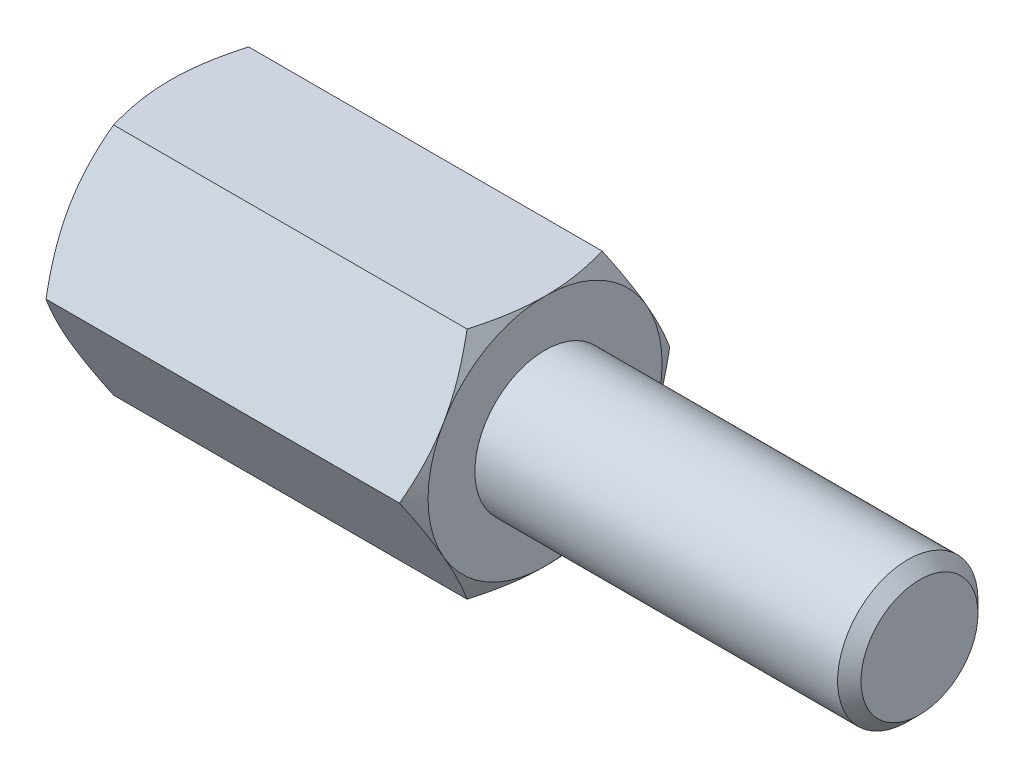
ISO-10303-21;
HEADER;
FILE_DESCRIPTION(('STEP AP214'),'2;1');
FILE_NAME('part.step','',(''),(''),'','','');
FILE_SCHEMA(('AUTOMOTIVE_DESIGN { 1 0 10303 214 1 1 1 1 }'));
ENDSEC;
DATA;
#1=APPLICATION_CONTEXT('core data for automotive mechanical design processes');
#2=APPLICATION_PROTOCOL_DEFINITION('international standard','automotive_design',2000,#1);
#3=PRODUCT_CONTEXT('',#1,'mechanical');
#4=PRODUCT('Part','Part','',(#3));
#5=PRODUCT_RELATED_PRODUCT_CATEGORY('part','',(#4));
#6=PRODUCT_DEFINITION_FORMATION('','',#4);
#7=PRODUCT_DEFINITION_CONTEXT('part definition',#1,'design');
#8=PRODUCT_DEFINITION('design','',#6,#7);
#9=PRODUCT_DEFINITION_SHAPE('','',#8);
#10=(LENGTH_UNIT() NAMED_UNIT(*) SI_UNIT(.MILLI.,.METRE.));
#11=(NAMED_UNIT(*) PLANE_ANGLE_UNIT() SI_UNIT($,.RADIAN.));
#12=(NAMED_UNIT(*) SI_UNIT($,.STERADIAN.) SOLID_ANGLE_UNIT());
#13=UNCERTAINTY_MEASURE_WITH_UNIT(LENGTH_MEASURE(1.E-05),#10,'distance_accuracy_value','');
#14=(GEOMETRIC_REPRESENTATION_CONTEXT(3) GLOBAL_UNCERTAINTY_ASSIGNED_CONTEXT((#13)) GLOBAL_UNIT_ASSIGNED_CONTEXT((#10,
#11,#12)) REPRESENTATION_CONTEXT('',''));
#15=CARTESIAN_POINT('',(0.,0.,0.));
#16=DIRECTION('',(0.,0.,1.));
#17=DIRECTION('',(1.,0.,0.));
#18=AXIS2_PLACEMENT_3D('',#15,#16,#17);
#19=CARTESIAN_POINT('',(4.,2.5,-1.44337567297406));
#20=DIRECTION('',(1.,0.,0.));
#21=DIRECTION('',(0.,0.,-1.));
#22=AXIS2_PLACEMENT_3D('',#19,#20,#21);
#23=PLANE('',#22);
#24=CARTESIAN_POINT('',(4.,0.,0.));
#25=DIRECTION('',(1.,0.,0.));
#26=DIRECTION('',(0.,0.,-1.));
#27=AXIS2_PLACEMENT_3D('',#24,#25,#26);
#28=CIRCLE('',#27,2.5);
#29=CARTESIAN_POINT('',(4.,-1.25,-2.1650635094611));
#30=VERTEX_POINT('',#29);
#31=CARTESIAN_POINT('',(4.,1.25,-2.1650635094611));
#32=VERTEX_POINT('',#31);
#33=EDGE_CURVE('E288',#30,#32,#28,.T.);
#34=ORIENTED_EDGE('',*,*,#33,.T.);
#35=CARTESIAN_POINT('',(4.,2.5,0.));
#36=VERTEX_POINT('',#35);
#37=EDGE_CURVE('E53',#32,#36,#28,.T.);
#38=ORIENTED_EDGE('',*,*,#37,.T.);
#39=CARTESIAN_POINT('',(4.,1.25,2.1650635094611));
#40=VERTEX_POINT('',#39);
#41=EDGE_CURVE('E295',#36,#40,#28,.T.);
#42=ORIENTED_EDGE('',*,*,#41,.T.);
#43=CARTESIAN_POINT('',(4.,-1.25,2.1650635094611));
#44=VERTEX_POINT('',#43);
#45=EDGE_CURVE('E299',#40,#44,#28,.T.);
#46=ORIENTED_EDGE('',*,*,#45,.T.);
#47=CARTESIAN_POINT('',(4.,0.,0.));
#48=DIRECTION('',(-1.,0.,0.));
#49=DIRECTION('',(0.,-1.,0.));
#50=AXIS2_PLACEMENT_3D('',#47,#48,#49);
#51=CIRCLE('',#50,2.5);
#52=CARTESIAN_POINT('',(4.,-2.5,0.));
#53=VERTEX_POINT('',#52);
#54=EDGE_CURVE('E193',#53,#44,#51,.T.);
#55=ORIENTED_EDGE('',*,*,#54,.F.);
#56=EDGE_CURVE('E61',#53,#30,#28,.T.);
#57=ORIENTED_EDGE('',*,*,#56,.T.);
#58=EDGE_LOOP('',(#34,#38,#42,#46,#55,#57));
#59=FACE_BOUND('',#58,.T.);
#60=CARTESIAN_POINT('',(4.,0.,0.));
#61=DIRECTION('',(1.,0.,0.));
#62=DIRECTION('',(0.,0.,-1.));
#63=AXIS2_PLACEMENT_3D('',#60,#61,#62);
#64=CIRCLE('',#63,1.5);
#65=CARTESIAN_POINT('',(4.,0.,-1.5));
#66=VERTEX_POINT('',#65);
#67=EDGE_CURVE('E386',#66,#66,#64,.T.);
#68=ORIENTED_EDGE('',*,*,#67,.F.);
#69=EDGE_LOOP('',(#68));
#70=FACE_BOUND('',#69,.T.);
#71=ADVANCED_FACE('F37',(#59,#70),#23,.T.);
#72=CARTESIAN_POINT('',(4.,0.,-2.88675134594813));
#73=DIRECTION('',(0.,-0.5,0.866025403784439));
#74=DIRECTION('',(0.,-0.866025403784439,-0.5));
#75=AXIS2_PLACEMENT_3D('',#72,#73,#74);
#76=PLANE('',#75);
#77=CARTESIAN_POINT('',(3.77664233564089,-0.000199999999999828,-2.88686681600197));
#78=CARTESIAN_POINT('',(3.81327837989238,0.109663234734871,-2.82343724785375));
#79=CARTESIAN_POINT('',(3.84659778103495,0.220474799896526,-2.75946016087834));
#80=CARTESIAN_POINT('',(3.90475771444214,0.444016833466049,-2.63039810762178));
#81=CARTESIAN_POINT('',(3.92957767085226,0.556751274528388,-2.5653108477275));
#82=CARTESIAN_POINT('',(3.96821434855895,0.780822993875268,-2.43594298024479));
#83=CARTESIAN_POINT('',(3.98228820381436,0.892125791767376,-2.37168227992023));
#84=CARTESIAN_POINT('',(3.99909084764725,1.11525522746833,-2.24285844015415));
#85=CARTESIAN_POINT('',(4.00183354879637,1.22708105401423,-2.17829576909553));
#86=CARTESIAN_POINT('',(3.99613423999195,1.43604197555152,-2.05765212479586));
#87=CARTESIAN_POINT('',(3.98909160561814,1.53320831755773,-2.0015531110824));
#88=CARTESIAN_POINT('',(3.96676858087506,1.726907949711,-1.88972057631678));
#89=CARTESIAN_POINT('',(3.95148056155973,1.82344056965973,-1.8339874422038));
#90=CARTESIAN_POINT('',(3.91326090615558,2.01753972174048,-1.7219242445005));
#91=CARTESIAN_POINT('',(3.89016722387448,2.11508168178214,-1.66560836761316));
#92=CARTESIAN_POINT('',(3.83775334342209,2.30871060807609,-1.55381665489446));
#93=CARTESIAN_POINT('',(3.80844546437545,2.40480005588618,-1.49833938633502));
#94=CARTESIAN_POINT('',(3.77664233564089,2.5002,-1.44326020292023));
#95=B_SPLINE_CURVE_WITH_KNOTS('',3,(#77,#78,#79,#80,#81,#82,#83,#84,#85,#86,#87,#88,#89,#90,#91,
#92,#93,#94),.UNSPECIFIED.,.F.,.F.,(4,2,2,2,2,2,2,2,4),(0.,0.396285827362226,0.79352433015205,
1.18093086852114,1.56786160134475,1.90479741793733,2.24204551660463,2.58677531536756,
2.93082800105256),.UNSPECIFIED.);
#96=CARTESIAN_POINT('',(3.7767090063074,0.,-2.88675134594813));
#97=VERTEX_POINT('',#96);
#98=EDGE_CURVE('E351',#97,#32,#95,.T.);
#99=ORIENTED_EDGE('',*,*,#98,.F.);
#100=DIRECTION('',(-1.,0.,0.));
#101=VECTOR('',#100,1.);
#102=CARTESIAN_POINT('',(4.,0.,-2.88675134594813));
#103=LINE('',#102,#101);
#104=CARTESIAN_POINT('',(-3.7767090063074,0.,-2.88675134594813));
#105=VERTEX_POINT('',#104);
#106=EDGE_CURVE('E264',#97,#105,#103,.T.);
#107=ORIENTED_EDGE('',*,*,#106,.T.);
#108=CARTESIAN_POINT('',(-3.77664233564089,2.5002,-1.44326020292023));
#109=CARTESIAN_POINT('',(-3.81327837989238,2.39033676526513,-1.50668977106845));
#110=CARTESIAN_POINT('',(-3.84659778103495,2.27952520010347,-1.57066685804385));
#111=CARTESIAN_POINT('',(-3.90475771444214,2.05598316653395,-1.69972891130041));
#112=CARTESIAN_POINT('',(-3.92957767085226,1.94324872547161,-1.7648161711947));
#113=CARTESIAN_POINT('',(-3.96821434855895,1.71917700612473,-1.8941840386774));
#114=CARTESIAN_POINT('',(-3.98228820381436,1.60787420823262,-1.95844473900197));
#115=CARTESIAN_POINT('',(-3.99909084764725,1.38474477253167,-2.08726857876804));
#116=CARTESIAN_POINT('',(-4.00183354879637,1.27291894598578,-2.15183124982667));
#117=CARTESIAN_POINT('',(-3.99613423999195,1.06395802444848,-2.27247489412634));
#118=CARTESIAN_POINT('',(-3.98909160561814,0.966791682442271,-2.32857390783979));
#119=CARTESIAN_POINT('',(-3.96676858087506,0.773092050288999,-2.44040644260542));
#120=CARTESIAN_POINT('',(-3.95148056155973,0.676559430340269,-2.49613957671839));
#121=CARTESIAN_POINT('',(-3.91326090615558,0.482460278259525,-2.60820277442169));
#122=CARTESIAN_POINT('',(-3.89016722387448,0.38491831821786,-2.66451865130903));
#123=CARTESIAN_POINT('',(-3.83775334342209,0.191289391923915,-2.77631036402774));
#124=CARTESIAN_POINT('',(-3.80844546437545,0.0951999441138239,-2.83178763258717));
#125=CARTESIAN_POINT('',(-3.77664233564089,-0.000200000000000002,-2.88686681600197));
#126=B_SPLINE_CURVE_WITH_KNOTS('',3,(#108,#109,#110,#111,#112,#113,#114,#115,#116,#117,#118,
#119,#120,#121,#122,#123,#124,#125),.UNSPECIFIED.,.F.,.F.,(4,2,2,2,2,2,2,2,4),(0.,
0.396285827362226,0.793524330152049,1.18093086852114,1.56786160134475,1.90479741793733,
2.24204551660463,2.58677531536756,2.93082800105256),.UNSPECIFIED.);
#127=CARTESIAN_POINT('',(-4.,1.25,-2.1650635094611));
#128=VERTEX_POINT('',#127);
#129=EDGE_CURVE('E398',#128,#105,#126,.T.);
#130=ORIENTED_EDGE('',*,*,#129,.F.);
#131=CARTESIAN_POINT('',(-3.7767090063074,2.5,-1.44337567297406));
#132=VERTEX_POINT('',#131);
#133=EDGE_CURVE('E310',#132,#128,#126,.T.);
#134=ORIENTED_EDGE('',*,*,#133,.F.);
#135=DIRECTION('',(-1.,0.,0.));
#136=VECTOR('',#135,1.);
#137=CARTESIAN_POINT('',(4.,2.5,-1.44337567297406));
#138=LINE('',#137,#136);
#139=CARTESIAN_POINT('',(3.77670900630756,2.5,-1.44337567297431));
#140=VERTEX_POINT('',#139);
#141=EDGE_CURVE('E279',#140,#132,#138,.T.);
#142=ORIENTED_EDGE('',*,*,#141,.F.);
#143=EDGE_CURVE('E229',#32,#140,#95,.T.);
#144=ORIENTED_EDGE('',*,*,#143,.F.);
#145=EDGE_LOOP('',(#99,#107,#130,#134,#142,#144));
#146=FACE_BOUND('',#145,.T.);
#147=ADVANCED_FACE('F148',(#146),#76,.F.);
#148=CARTESIAN_POINT('',(4.,2.5,-1.44337567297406));
#149=DIRECTION('',(0.,-1.,0.));
#150=DIRECTION('',(0.,0.,-1.));
#151=AXIS2_PLACEMENT_3D('',#148,#149,#150);
#152=PLANE('',#151);
#153=CARTESIAN_POINT('',(2.76803388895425,2.5,-3.90158441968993));
#154=CARTESIAN_POINT('',(2.82120772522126,2.5,-3.79217004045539));
#155=CARTESIAN_POINT('',(2.87387869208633,2.5,-3.68250707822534));
#156=CARTESIAN_POINT('',(2.97793249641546,2.5,-3.46255185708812));
#157=CARTESIAN_POINT('',(3.02931513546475,2.5,-3.35225950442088));
#158=CARTESIAN_POINT('',(3.13076309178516,2.5,-3.130356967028));
#159=CARTESIAN_POINT('',(3.18081992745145,2.5,-3.01874289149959));
#160=CARTESIAN_POINT('',(3.27891712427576,2.5,-2.79463535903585));
#161=CARTESIAN_POINT('',(3.32695757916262,2.5,-2.68214194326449));
#162=CARTESIAN_POINT('',(3.42201845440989,2.5,-2.45240385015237));
#163=CARTESIAN_POINT('',(3.46895431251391,2.5,-2.33512399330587));
#164=CARTESIAN_POINT('',(3.55933269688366,2.5,-2.09920133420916));
#165=CARTESIAN_POINT('',(3.60277483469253,2.5,-1.98055838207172));
#166=CARTESIAN_POINT('',(3.68504351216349,2.5,-1.74193489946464));
#167=CARTESIAN_POINT('',(3.72387917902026,2.5,-1.6219575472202));
#168=CARTESIAN_POINT('',(3.79570507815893,2.5,-1.38028205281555));
#169=CARTESIAN_POINT('',(3.82869712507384,2.5,-1.25858445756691));
#170=CARTESIAN_POINT('',(3.88709594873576,2.5,-1.01406369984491));
#171=CARTESIAN_POINT('',(3.91254379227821,2.5,-0.891250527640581));
#172=CARTESIAN_POINT('',(3.95442751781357,2.5,-0.64407172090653));
#173=CARTESIAN_POINT('',(3.97086432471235,2.5,-0.519706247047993));
#174=CARTESIAN_POINT('',(3.9932006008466,2.5,-0.271679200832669));
#175=CARTESIAN_POINT('',(3.99923751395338,2.5,-0.148030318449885));
#176=CARTESIAN_POINT('',(4.00062561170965,2.5,0.0993395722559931));
#177=CARTESIAN_POINT('',(3.99597656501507,2.5,0.223060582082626));
#178=CARTESIAN_POINT('',(3.97940443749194,2.5,0.432351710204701));
#179=CARTESIAN_POINT('',(3.97010665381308,2.5,0.518143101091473));
#180=CARTESIAN_POINT('',(3.94693847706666,2.5,0.689112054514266));
#181=CARTESIAN_POINT('',(3.93306748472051,2.5,0.774289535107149));
#182=CARTESIAN_POINT('',(3.88532020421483,2.5,1.02876599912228));
#183=CARTESIAN_POINT('',(3.84531764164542,2.5,1.19691958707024));
#184=CARTESIAN_POINT('',(3.75226567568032,2.5,1.53362893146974));
#185=CARTESIAN_POINT('',(3.69893620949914,2.5,1.70210423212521));
#186=CARTESIAN_POINT('',(3.61237169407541,2.5,1.95247339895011));
#187=CARTESIAN_POINT('',(3.58242477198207,2.5,2.03553184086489));
#188=CARTESIAN_POINT('',(3.52068409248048,2.5,2.20095860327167));
#189=CARTESIAN_POINT('',(3.48889037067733,2.5,2.2833269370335));
#190=CARTESIAN_POINT('',(3.40401426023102,2.5,2.49723312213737));
#191=CARTESIAN_POINT('',(3.34971733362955,2.5,2.6282879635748));
#192=CARTESIAN_POINT('',(3.23812739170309,2.5,2.88912034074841));
#193=CARTESIAN_POINT('',(3.1808341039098,2.5,3.01889775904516));
#194=CARTESIAN_POINT('',(3.06393487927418,2.5,3.27745045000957));
#195=CARTESIAN_POINT('',(3.00432825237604,2.5,3.40622540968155));
#196=CARTESIAN_POINT('',(2.8833234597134,2.5,3.66293235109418));
#197=CARTESIAN_POINT('',(2.82192524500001,2.5,3.79086430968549));
#198=CARTESIAN_POINT('',(2.6354580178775,2.5,4.17399495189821));
#199=CARTESIAN_POINT('',(2.50828249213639,2.5,4.42816724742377));
#200=CARTESIAN_POINT('',(2.25034557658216,2.5,4.93461464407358));
#201=CARTESIAN_POINT('',(2.11958483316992,2.5,5.18689007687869));
#202=CARTESIAN_POINT('',(1.86871001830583,2.5,5.66512451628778));
#203=CARTESIAN_POINT('',(1.74882986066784,2.5,5.89120644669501));
#204=CARTESIAN_POINT('',(1.50759021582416,2.5,6.34259369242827));
#205=CARTESIAN_POINT('',(1.38623065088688,2.5,6.56789896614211));
#206=CARTESIAN_POINT('',(1.14278038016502,2.5,7.01722044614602));
#207=CARTESIAN_POINT('',(1.02069305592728,2.5,7.24123848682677));
#208=CARTESIAN_POINT('',(0.775666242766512,2.5,7.68878772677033));
#209=CARTESIAN_POINT('',(0.652726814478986,2.5,7.9123189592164));
#210=CARTESIAN_POINT('',(0.529475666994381,2.5,8.13567697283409));
#211=B_SPLINE_CURVE_WITH_KNOTS('',3,(#153,#154,#155,#156,#157,#158,#159,#160,#161,#162,#163,
#164,#165,#166,#167,#168,#169,#170,#171,#172,#173,#174,#175,#176,#177,#178,#179,#180,#181,#182,
#183,#184,#185,#186,#187,#188,#189,#190,#191,#192,#193,#194,#195,#196,#197,#198,#199,#200,#201,
#202,#203,#204,#205,#206,#207,#208,#209,#210),.UNSPECIFIED.,.F.,.F.,(4,2,2,2,2,2,2,2,2,2,2,2,2,
2,2,2,2,2,2,2,2,2,2,2,2,2,2,2,4),(0.,0.364957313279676,0.729970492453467,1.09692930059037,
1.46387103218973,1.84279746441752,2.22176597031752,2.59997058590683,2.97805755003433,
3.35404692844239,3.72999770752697,4.10094071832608,4.47189175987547,4.73064905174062,
4.98944026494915,5.5072907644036,6.03710483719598,6.30196454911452,6.56681915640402,
6.99233818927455,7.41789598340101,7.84358170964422,8.26927907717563,9.12186602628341,
9.97430025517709,10.7419897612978,11.5097197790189,12.2750964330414,13.0404191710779),.UNSPECIFIED.);
#212=EDGE_CURVE('E227',#140,#36,#211,.T.);
#213=ORIENTED_EDGE('',*,*,#212,.F.);
#214=ORIENTED_EDGE('',*,*,#141,.T.);
#215=CARTESIAN_POINT('',(-2.76803388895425,2.5,-3.90158441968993));
#216=CARTESIAN_POINT('',(-2.82120772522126,2.5,-3.79217004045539));
#217=CARTESIAN_POINT('',(-2.87387869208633,2.5,-3.68250707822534));
#218=CARTESIAN_POINT('',(-2.97793249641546,2.5,-3.46255185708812));
#219=CARTESIAN_POINT('',(-3.02931513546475,2.5,-3.35225950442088));
#220=CARTESIAN_POINT('',(-3.13076309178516,2.5,-3.130356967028));
#221=CARTESIAN_POINT('',(-3.18081992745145,2.5,-3.01874289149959));
#222=CARTESIAN_POINT('',(-3.27891712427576,2.5,-2.79463535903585));
#223=CARTESIAN_POINT('',(-3.32695757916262,2.5,-2.68214194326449));
#224=CARTESIAN_POINT('',(-3.42201845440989,2.5,-2.45240385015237));
#225=CARTESIAN_POINT('',(-3.46895431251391,2.5,-2.33512399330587));
#226=CARTESIAN_POINT('',(-3.55933269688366,2.5,-2.09920133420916));
#227=CARTESIAN_POINT('',(-3.60277483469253,2.5,-1.98055838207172));
#228=CARTESIAN_POINT('',(-3.68504351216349,2.5,-1.74193489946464));
#229=CARTESIAN_POINT('',(-3.72387917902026,2.5,-1.6219575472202));
#230=CARTESIAN_POINT('',(-3.79570507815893,2.5,-1.38028205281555));
#231=CARTESIAN_POINT('',(-3.82869712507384,2.5,-1.25858445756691));
#232=CARTESIAN_POINT('',(-3.88709594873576,2.5,-1.01406369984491));
#233=CARTESIAN_POINT('',(-3.91254379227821,2.5,-0.89125052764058));
#234=CARTESIAN_POINT('',(-3.95442751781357,2.5,-0.64407172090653));
#235=CARTESIAN_POINT('',(-3.97086432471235,2.5,-0.519706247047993));
#236=CARTESIAN_POINT('',(-3.9932006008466,2.5,-0.271679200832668));
#237=CARTESIAN_POINT('',(-3.99923751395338,2.5,-0.148030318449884));
#238=CARTESIAN_POINT('',(-4.00062561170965,2.5,0.0993395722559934));
#239=CARTESIAN_POINT('',(-3.99597656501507,2.5,0.223060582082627));
#240=CARTESIAN_POINT('',(-3.97940443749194,2.5,0.432351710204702));
#241=CARTESIAN_POINT('',(-3.97010665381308,2.5,0.518143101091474));
#242=CARTESIAN_POINT('',(-3.94693847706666,2.5,0.689112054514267));
#243=CARTESIAN_POINT('',(-3.93306748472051,2.5,0.774289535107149));
#244=CARTESIAN_POINT('',(-3.88532020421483,2.5,1.02876599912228));
#245=CARTESIAN_POINT('',(-3.84531764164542,2.5,1.19691958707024));
#246=CARTESIAN_POINT('',(-3.75226567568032,2.5,1.53362893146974));
#247=CARTESIAN_POINT('',(-3.69893620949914,2.5,1.70210423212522));
#248=CARTESIAN_POINT('',(-3.61237169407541,2.5,1.95247339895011));
#249=CARTESIAN_POINT('',(-3.58242477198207,2.5,2.03553184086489));
#250=CARTESIAN_POINT('',(-3.52068409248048,2.5,2.20095860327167));
#251=CARTESIAN_POINT('',(-3.48889037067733,2.5,2.2833269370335));
#252=CARTESIAN_POINT('',(-3.40401426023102,2.5,2.49723312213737));
#253=CARTESIAN_POINT('',(-3.34971733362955,2.5,2.6282879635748));
#254=CARTESIAN_POINT('',(-3.23812739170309,2.5,2.88912034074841));
#255=CARTESIAN_POINT('',(-3.1808341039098,2.5,3.01889775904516));
#256=CARTESIAN_POINT('',(-3.06393487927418,2.5,3.27745045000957));
#257=CARTESIAN_POINT('',(-3.00432825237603,2.5,3.40622540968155));
#258=CARTESIAN_POINT('',(-2.8833234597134,2.5,3.66293235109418));
#259=CARTESIAN_POINT('',(-2.82192524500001,2.5,3.79086430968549));
#260=CARTESIAN_POINT('',(-2.6354580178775,2.5,4.17399495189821));
#261=CARTESIAN_POINT('',(-2.50828249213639,2.5,4.42816724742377));
#262=CARTESIAN_POINT('',(-2.25034557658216,2.5,4.93461464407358));
#263=CARTESIAN_POINT('',(-2.11958483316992,2.5,5.18689007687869));
#264=CARTESIAN_POINT('',(-1.86871001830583,2.5,5.66512451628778));
#265=CARTESIAN_POINT('',(-1.74882986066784,2.5,5.89120644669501));
#266=CARTESIAN_POINT('',(-1.50759021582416,2.5,6.34259369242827));
#267=CARTESIAN_POINT('',(-1.38623065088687,2.5,6.56789896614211));
#268=CARTESIAN_POINT('',(-1.14278038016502,2.5,7.01722044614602));
#269=CARTESIAN_POINT('',(-1.02069305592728,2.5,7.24123848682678));
#270=CARTESIAN_POINT('',(-0.775666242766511,2.5,7.68878772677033));
#271=CARTESIAN_POINT('',(-0.652726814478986,2.5,7.9123189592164));
#272=CARTESIAN_POINT('',(-0.529475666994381,2.5,8.13567697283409));
#273=B_SPLINE_CURVE_WITH_KNOTS('',3,(#215,#216,#217,#218,#219,#220,#221,#222,#223,#224,#225,
#226,#227,#228,#229,#230,#231,#232,#233,#234,#235,#236,#237,#238,#239,#240,#241,#242,#243,#244,
#245,#246,#247,#248,#249,#250,#251,#252,#253,#254,#255,#256,#257,#258,#259,#260,#261,#262,#263,
#264,#265,#266,#267,#268,#269,#270,#271,#272),.UNSPECIFIED.,.F.,.F.,(4,2,2,2,2,2,2,2,2,2,2,2,2,
2,2,2,2,2,2,2,2,2,2,2,2,2,2,2,4),(0.,0.364957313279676,0.729970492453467,1.09692930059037,
1.46387103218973,1.84279746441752,2.22176597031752,2.59997058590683,2.97805755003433,
3.35404692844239,3.72999770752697,4.10094071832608,4.47189175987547,4.73064905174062,
4.98944026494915,5.5072907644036,6.03710483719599,6.30196454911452,6.56681915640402,
6.99233818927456,7.41789598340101,7.84358170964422,8.26927907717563,9.12186602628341,
9.97430025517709,10.7419897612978,11.5097197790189,12.2750964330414,13.0404191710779),.UNSPECIFIED.);
#274=CARTESIAN_POINT('',(-4.,2.5,0.));
#275=VERTEX_POINT('',#274);
#276=EDGE_CURVE('E241',#275,#132,#273,.F.);
#277=ORIENTED_EDGE('',*,*,#276,.F.);
#278=CARTESIAN_POINT('',(-3.7767090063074,2.5,1.44337567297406));
#279=VERTEX_POINT('',#278);
#280=EDGE_CURVE('E249',#279,#275,#273,.F.);
#281=ORIENTED_EDGE('',*,*,#280,.F.);
#282=DIRECTION('',(-1.,0.,0.));
#283=VECTOR('',#282,1.);
#284=CARTESIAN_POINT('',(4.,2.5,1.44337567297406));
#285=LINE('',#284,#283);
#286=CARTESIAN_POINT('',(3.7767090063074,2.5,1.44337567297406));
#287=VERTEX_POINT('',#286);
#288=EDGE_CURVE('E276',#287,#279,#285,.T.);
#289=ORIENTED_EDGE('',*,*,#288,.F.);
#290=EDGE_CURVE('E221',#36,#287,#211,.T.);
#291=ORIENTED_EDGE('',*,*,#290,.F.);
#292=EDGE_LOOP('',(#213,#214,#277,#281,#289,#291));
#293=FACE_BOUND('',#292,.T.);
#294=ADVANCED_FACE('F153',(#293),#152,.F.);
#295=CARTESIAN_POINT('',(4.,2.5,1.44337567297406));
#296=DIRECTION('',(0.,-0.5,-0.866025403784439));
#297=DIRECTION('',(0.,0.866025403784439,-0.5));
#298=AXIS2_PLACEMENT_3D('',#295,#296,#297);
#299=PLANE('',#298);
#300=CARTESIAN_POINT('',(3.77664233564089,2.5002,1.44326020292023));
#301=CARTESIAN_POINT('',(3.81327837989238,2.39033676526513,1.50668977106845));
#302=CARTESIAN_POINT('',(3.84659778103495,2.27952520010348,1.57066685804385));
#303=CARTESIAN_POINT('',(3.90475771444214,2.05598316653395,1.69972891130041));
#304=CARTESIAN_POINT('',(3.92957767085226,1.94324872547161,1.7648161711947));
#305=CARTESIAN_POINT('',(3.96821434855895,1.71917700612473,1.8941840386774));
#306=CARTESIAN_POINT('',(3.98228820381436,1.60787420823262,1.95844473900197));
#307=CARTESIAN_POINT('',(3.99909084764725,1.38474477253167,2.08726857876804));
#308=CARTESIAN_POINT('',(4.00183354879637,1.27291894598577,2.15183124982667));
#309=CARTESIAN_POINT('',(3.99613423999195,1.06395802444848,2.27247489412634));
#310=CARTESIAN_POINT('',(3.98909160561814,0.96679168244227,2.32857390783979));
#311=CARTESIAN_POINT('',(3.96676858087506,0.773092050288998,2.44040644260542));
#312=CARTESIAN_POINT('',(3.95148056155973,0.676559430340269,2.49613957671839));
#313=CARTESIAN_POINT('',(3.91326090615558,0.482460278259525,2.60820277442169));
#314=CARTESIAN_POINT('',(3.89016722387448,0.384918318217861,2.66451865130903));
#315=CARTESIAN_POINT('',(3.83775334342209,0.191289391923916,2.77631036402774));
#316=CARTESIAN_POINT('',(3.80844546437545,0.0951999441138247,2.83178763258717));
#317=CARTESIAN_POINT('',(3.77664233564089,-0.000199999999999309,2.88686681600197));
#318=B_SPLINE_CURVE_WITH_KNOTS('',3,(#300,#301,#302,#303,#304,#305,#306,#307,#308,#309,#310,
#311,#312,#313,#314,#315,#316,#317),.UNSPECIFIED.,.F.,.F.,(4,2,2,2,2,2,2,2,4),(0.,
0.396285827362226,0.79352433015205,1.18093086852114,1.56786160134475,1.90479741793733,
2.24204551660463,2.58677531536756,2.93082800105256),.UNSPECIFIED.);
#319=EDGE_CURVE('E228',#287,#40,#318,.T.);
#320=ORIENTED_EDGE('',*,*,#319,.F.);
#321=ORIENTED_EDGE('',*,*,#288,.T.);
#322=CARTESIAN_POINT('',(-3.77664233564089,-0.00019999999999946,2.88686681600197));
#323=CARTESIAN_POINT('',(-3.81327837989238,0.109663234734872,2.82343724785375));
#324=CARTESIAN_POINT('',(-3.84659778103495,0.220474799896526,2.75946016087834));
#325=CARTESIAN_POINT('',(-3.90475771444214,0.44401683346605,2.63039810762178));
#326=CARTESIAN_POINT('',(-3.92957767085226,0.556751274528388,2.5653108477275));
#327=CARTESIAN_POINT('',(-3.96821434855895,0.780822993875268,2.43594298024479));
#328=CARTESIAN_POINT('',(-3.98228820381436,0.892125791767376,2.37168227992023));
#329=CARTESIAN_POINT('',(-3.99909084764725,1.11525522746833,2.24285844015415));
#330=CARTESIAN_POINT('',(-4.00183354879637,1.22708105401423,2.17829576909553));
#331=CARTESIAN_POINT('',(-3.99613423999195,1.43604197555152,2.05765212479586));
#332=CARTESIAN_POINT('',(-3.98909160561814,1.53320831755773,2.0015531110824));
#333=CARTESIAN_POINT('',(-3.96676858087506,1.726907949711,1.88972057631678));
#334=CARTESIAN_POINT('',(-3.95148056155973,1.82344056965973,1.8339874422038));
#335=CARTESIAN_POINT('',(-3.91326090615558,2.01753972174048,1.7219242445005));
#336=CARTESIAN_POINT('',(-3.89016722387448,2.11508168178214,1.66560836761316));
#337=CARTESIAN_POINT('',(-3.83775334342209,2.30871060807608,1.55381665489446));
#338=CARTESIAN_POINT('',(-3.80844546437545,2.40480005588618,1.49833938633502));
#339=CARTESIAN_POINT('',(-3.77664233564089,2.5002,1.44326020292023));
#340=B_SPLINE_CURVE_WITH_KNOTS('',3,(#322,#323,#324,#325,#326,#327,#328,#329,#330,#331,#332,
#333,#334,#335,#336,#337,#338,#339),.UNSPECIFIED.,.F.,.F.,(4,2,2,2,2,2,2,2,4),(0.,
0.396285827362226,0.793524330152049,1.18093086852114,1.56786160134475,1.90479741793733,
2.24204551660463,2.58677531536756,2.93082800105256),.UNSPECIFIED.);
#341=CARTESIAN_POINT('',(-4.,1.25,2.1650635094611));
#342=VERTEX_POINT('',#341);
#343=EDGE_CURVE('E255',#342,#279,#340,.T.);
#344=ORIENTED_EDGE('',*,*,#343,.F.);
#345=CARTESIAN_POINT('',(-3.7767090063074,0.,2.88675134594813));
#346=VERTEX_POINT('',#345);
#347=EDGE_CURVE('E262',#346,#342,#340,.T.);
#348=ORIENTED_EDGE('',*,*,#347,.F.);
#349=DIRECTION('',(-1.,0.,0.));
#350=VECTOR('',#349,1.);
#351=CARTESIAN_POINT('',(4.,0.,2.88675134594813));
#352=LINE('',#351,#350);
#353=CARTESIAN_POINT('',(3.7767090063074,0.,2.88675134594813));
#354=VERTEX_POINT('',#353);
#355=EDGE_CURVE('E273',#354,#346,#352,.T.);
#356=ORIENTED_EDGE('',*,*,#355,.F.);
#357=EDGE_CURVE('E215',#40,#354,#318,.T.);
#358=ORIENTED_EDGE('',*,*,#357,.F.);
#359=EDGE_LOOP('',(#320,#321,#344,#348,#356,#358));
#360=FACE_BOUND('',#359,.T.);
#361=ADVANCED_FACE('F235',(#360),#299,.F.);
#362=CARTESIAN_POINT('',(4.,0.,2.88675134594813));
#363=DIRECTION('',(0.,0.5,-0.866025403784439));
#364=DIRECTION('',(0.,0.866025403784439,0.5));
#365=AXIS2_PLACEMENT_3D('',#362,#363,#364);
#366=PLANE('',#365);
#367=CARTESIAN_POINT('',(3.77664233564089,0.000200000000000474,2.88686681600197));
#368=CARTESIAN_POINT('',(3.81327837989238,-0.109663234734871,2.82343724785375));
#369=CARTESIAN_POINT('',(3.84659778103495,-0.220474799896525,2.75946016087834));
#370=CARTESIAN_POINT('',(3.90475771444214,-0.444016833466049,2.63039810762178));
#371=CARTESIAN_POINT('',(3.92957767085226,-0.556751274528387,2.5653108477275));
#372=CARTESIAN_POINT('',(3.96821434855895,-0.780822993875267,2.43594298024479));
#373=CARTESIAN_POINT('',(3.98228820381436,-0.892125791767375,2.37168227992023));
#374=CARTESIAN_POINT('',(3.99909084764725,-1.11525522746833,2.24285844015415));
#375=CARTESIAN_POINT('',(4.00183354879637,-1.22708105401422,2.17829576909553));
#376=CARTESIAN_POINT('',(3.99613423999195,-1.43604197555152,2.05765212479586));
#377=CARTESIAN_POINT('',(3.98909160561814,-1.53320831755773,2.0015531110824));
#378=CARTESIAN_POINT('',(3.96676858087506,-1.726907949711,1.88972057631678));
#379=CARTESIAN_POINT('',(3.95148056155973,-1.82344056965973,1.8339874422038));
#380=CARTESIAN_POINT('',(3.91326090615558,-2.01753972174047,1.7219242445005));
#381=CARTESIAN_POINT('',(3.89016722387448,-2.11508168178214,1.66560836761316));
#382=CARTESIAN_POINT('',(3.83775334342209,-2.30871060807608,1.55381665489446));
#383=CARTESIAN_POINT('',(3.80844546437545,-2.40480005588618,1.49833938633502));
#384=CARTESIAN_POINT('',(3.77664233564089,-2.5002,1.44326020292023));
#385=B_SPLINE_CURVE_WITH_KNOTS('',3,(#367,#368,#369,#370,#371,#372,#373,#374,#375,#376,#377,
#378,#379,#380,#381,#382,#383,#384),.UNSPECIFIED.,.F.,.F.,(4,2,2,2,2,2,2,2,4),(0.,
0.396285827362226,0.793524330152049,1.18093086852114,1.56786160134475,1.90479741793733,
2.24204551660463,2.58677531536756,2.93082800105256),.UNSPECIFIED.);
#386=EDGE_CURVE('E370',#354,#44,#385,.T.);
#387=ORIENTED_EDGE('',*,*,#386,.F.);
#388=ORIENTED_EDGE('',*,*,#355,.T.);
#389=CARTESIAN_POINT('',(-3.77664233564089,-2.5002,1.44326020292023));
#390=CARTESIAN_POINT('',(-3.81327837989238,-2.39033676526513,1.50668977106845));
#391=CARTESIAN_POINT('',(-3.84659778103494,-2.27952520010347,1.57066685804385));
#392=CARTESIAN_POINT('',(-3.90475771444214,-2.05598316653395,1.69972891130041));
#393=CARTESIAN_POINT('',(-3.92957767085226,-1.94324872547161,1.7648161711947));
#394=CARTESIAN_POINT('',(-3.96821434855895,-1.71917700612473,1.8941840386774));
#395=CARTESIAN_POINT('',(-3.98228820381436,-1.60787420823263,1.95844473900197));
#396=CARTESIAN_POINT('',(-3.99909084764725,-1.38474477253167,2.08726857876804));
#397=CARTESIAN_POINT('',(-4.00183354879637,-1.27291894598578,2.15183124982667));
#398=CARTESIAN_POINT('',(-3.99613423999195,-1.06395802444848,2.27247489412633));
#399=CARTESIAN_POINT('',(-3.98909160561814,-0.966791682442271,2.32857390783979));
#400=CARTESIAN_POINT('',(-3.96676858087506,-0.773092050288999,2.44040644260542));
#401=CARTESIAN_POINT('',(-3.95148056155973,-0.676559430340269,2.49613957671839));
#402=CARTESIAN_POINT('',(-3.91326090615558,-0.482460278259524,2.60820277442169));
#403=CARTESIAN_POINT('',(-3.89016722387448,-0.38491831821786,2.66451865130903));
#404=CARTESIAN_POINT('',(-3.83775334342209,-0.191289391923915,2.77631036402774));
#405=CARTESIAN_POINT('',(-3.80844546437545,-0.0951999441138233,2.83178763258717));
#406=CARTESIAN_POINT('',(-3.77664233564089,0.000200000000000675,2.88686681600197));
#407=B_SPLINE_CURVE_WITH_KNOTS('',3,(#389,#390,#391,#392,#393,#394,#395,#396,#397,#398,#399,
#400,#401,#402,#403,#404,#405,#406),.UNSPECIFIED.,.F.,.F.,(4,2,2,2,2,2,2,2,4),(0.,
0.396285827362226,0.793524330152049,1.18093086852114,1.56786160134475,1.90479741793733,
2.24204551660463,2.58677531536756,2.93082800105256),.UNSPECIFIED.);
#408=CARTESIAN_POINT('',(-4.,-1.25,2.1650635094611));
#409=VERTEX_POINT('',#408);
#410=EDGE_CURVE('E263',#409,#346,#407,.T.);
#411=ORIENTED_EDGE('',*,*,#410,.F.);
#412=CARTESIAN_POINT('',(-3.7767090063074,-2.5,1.44337567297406));
#413=VERTEX_POINT('',#412);
#414=EDGE_CURVE('E250',#413,#409,#407,.T.);
#415=ORIENTED_EDGE('',*,*,#414,.F.);
#416=DIRECTION('',(-1.,0.,0.));
#417=VECTOR('',#416,1.);
#418=CARTESIAN_POINT('',(4.,-2.5,1.44337567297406));
#419=LINE('',#418,#417);
#420=CARTESIAN_POINT('',(3.7767090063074,-2.5,1.44337567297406));
#421=VERTEX_POINT('',#420);
#422=EDGE_CURVE('E270',#421,#413,#419,.T.);
#423=ORIENTED_EDGE('',*,*,#422,.F.);
#424=EDGE_CURVE('E210',#44,#421,#385,.T.);
#425=ORIENTED_EDGE('',*,*,#424,.F.);
#426=EDGE_LOOP('',(#387,#388,#411,#415,#423,#425));
#427=FACE_BOUND('',#426,.T.);
#428=ADVANCED_FACE('F419',(#427),#366,.F.);
#429=CARTESIAN_POINT('',(4.,-2.5,1.44337567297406));
#430=DIRECTION('',(0.,1.,0.));
#431=DIRECTION('',(0.,0.,1.));
#432=AXIS2_PLACEMENT_3D('',#429,#430,#431);
#433=PLANE('',#432);
#434=CARTESIAN_POINT('',(2.76803388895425,-2.5,-3.90158441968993));
#435=CARTESIAN_POINT('',(2.82120772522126,-2.5,-3.79217004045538));
#436=CARTESIAN_POINT('',(2.87387869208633,-2.5,-3.68250707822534));
#437=CARTESIAN_POINT('',(2.97793249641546,-2.5,-3.46255185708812));
#438=CARTESIAN_POINT('',(3.02931513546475,-2.5,-3.35225950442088));
#439=CARTESIAN_POINT('',(3.13076309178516,-2.5,-3.130356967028));
#440=CARTESIAN_POINT('',(3.18081992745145,-2.5,-3.01874289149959));
#441=CARTESIAN_POINT('',(3.27891712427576,-2.5,-2.79463535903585));
#442=CARTESIAN_POINT('',(3.32695757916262,-2.5,-2.68214194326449));
#443=CARTESIAN_POINT('',(3.42201845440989,-2.5,-2.45240385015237));
#444=CARTESIAN_POINT('',(3.46895431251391,-2.5,-2.33512399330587));
#445=CARTESIAN_POINT('',(3.55933269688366,-2.5,-2.09920133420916));
#446=CARTESIAN_POINT('',(3.60277483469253,-2.5,-1.98055838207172));
#447=CARTESIAN_POINT('',(3.68504351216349,-2.5,-1.74193489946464));
#448=CARTESIAN_POINT('',(3.72387917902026,-2.5,-1.6219575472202));
#449=CARTESIAN_POINT('',(3.79570507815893,-2.5,-1.38028205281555));
#450=CARTESIAN_POINT('',(3.82869712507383,-2.5,-1.25858445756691));
#451=CARTESIAN_POINT('',(3.88709594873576,-2.5,-1.01406369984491));
#452=CARTESIAN_POINT('',(3.91254379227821,-2.5,-0.891250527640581));
#453=CARTESIAN_POINT('',(3.95442751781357,-2.5,-0.644071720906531));
#454=CARTESIAN_POINT('',(3.97086432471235,-2.5,-0.519706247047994));
#455=CARTESIAN_POINT('',(3.9932006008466,-2.5,-0.27167920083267));
#456=CARTESIAN_POINT('',(3.99923751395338,-2.5,-0.148030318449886));
#457=CARTESIAN_POINT('',(4.00062561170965,-2.5,0.0993395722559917));
#458=CARTESIAN_POINT('',(3.99597656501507,-2.5,0.223060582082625));
#459=CARTESIAN_POINT('',(3.97940443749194,-2.5,0.432351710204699));
#460=CARTESIAN_POINT('',(3.97010665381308,-2.5,0.518143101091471));
#461=CARTESIAN_POINT('',(3.94693847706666,-2.5,0.689112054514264));
#462=CARTESIAN_POINT('',(3.93306748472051,-2.5,0.774289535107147));
#463=CARTESIAN_POINT('',(3.88532020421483,-2.5,1.02876599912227));
#464=CARTESIAN_POINT('',(3.84531764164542,-2.5,1.19691958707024));
#465=CARTESIAN_POINT('',(3.75226567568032,-2.5,1.53362893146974));
#466=CARTESIAN_POINT('',(3.69893620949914,-2.5,1.70210423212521));
#467=CARTESIAN_POINT('',(3.61237169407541,-2.5,1.95247339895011));
#468=CARTESIAN_POINT('',(3.58242477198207,-2.5,2.03553184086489));
#469=CARTESIAN_POINT('',(3.52068409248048,-2.5,2.20095860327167));
#470=CARTESIAN_POINT('',(3.48889037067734,-2.5,2.2833269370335));
#471=CARTESIAN_POINT('',(3.40401426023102,-2.5,2.49723312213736));
#472=CARTESIAN_POINT('',(3.34971733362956,-2.5,2.6282879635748));
#473=CARTESIAN_POINT('',(3.2381273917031,-2.5,2.8891203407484));
#474=CARTESIAN_POINT('',(3.1808341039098,-2.5,3.01889775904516));
#475=CARTESIAN_POINT('',(3.06393487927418,-2.5,3.27745045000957));
#476=CARTESIAN_POINT('',(3.00432825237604,-2.5,3.40622540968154));
#477=CARTESIAN_POINT('',(2.8833234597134,-2.5,3.66293235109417));
#478=CARTESIAN_POINT('',(2.82192524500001,-2.5,3.79086430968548));
#479=CARTESIAN_POINT('',(2.6354580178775,-2.5,4.1739949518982));
#480=CARTESIAN_POINT('',(2.50828249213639,-2.5,4.42816724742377));
#481=CARTESIAN_POINT('',(2.25034557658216,-2.5,4.93461464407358));
#482=CARTESIAN_POINT('',(2.11958483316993,-2.5,5.18689007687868));
#483=CARTESIAN_POINT('',(1.86871001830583,-2.5,5.66512451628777));
#484=CARTESIAN_POINT('',(1.74882986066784,-2.5,5.891206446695));
#485=CARTESIAN_POINT('',(1.50759021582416,-2.5,6.34259369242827));
#486=CARTESIAN_POINT('',(1.38623065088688,-2.5,6.5678989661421));
#487=CARTESIAN_POINT('',(1.14278038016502,-2.5,7.01722044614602));
#488=CARTESIAN_POINT('',(1.02069305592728,-2.5,7.24123848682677));
#489=CARTESIAN_POINT('',(0.775666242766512,-2.5,7.68878772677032));
#490=CARTESIAN_POINT('',(0.652726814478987,-2.5,7.9123189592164));
#491=CARTESIAN_POINT('',(0.529475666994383,-2.5,8.13567697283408));
#492=B_SPLINE_CURVE_WITH_KNOTS('',3,(#434,#435,#436,#437,#438,#439,#440,#441,#442,#443,#444,
#445,#446,#447,#448,#449,#450,#451,#452,#453,#454,#455,#456,#457,#458,#459,#460,#461,#462,#463,
#464,#465,#466,#467,#468,#469,#470,#471,#472,#473,#474,#475,#476,#477,#478,#479,#480,#481,#482,
#483,#484,#485,#486,#487,#488,#489,#490,#491),.UNSPECIFIED.,.F.,.F.,(4,2,2,2,2,2,2,2,2,2,2,2,2,
2,2,2,2,2,2,2,2,2,2,2,2,2,2,2,4),(0.,0.364957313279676,0.729970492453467,1.09692930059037,
1.46387103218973,1.84279746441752,2.22176597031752,2.59997058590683,2.97805755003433,
3.35404692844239,3.72999770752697,4.10094071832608,4.47189175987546,4.73064905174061,
4.98944026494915,5.50729076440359,6.03710483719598,6.30196454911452,6.56681915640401,
6.99233818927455,7.417895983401,7.84358170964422,8.26927907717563,9.1218660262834,
9.97430025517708,10.7419897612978,11.5097197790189,12.2750964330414,13.0404191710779),.UNSPECIFIED.);
#493=EDGE_CURVE('E378',#421,#53,#492,.F.);
#494=ORIENTED_EDGE('',*,*,#493,.F.);
#495=ORIENTED_EDGE('',*,*,#422,.T.);
#496=CARTESIAN_POINT('',(-2.76803388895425,-2.5,-3.90158441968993));
#497=CARTESIAN_POINT('',(-2.82120772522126,-2.5,-3.79217004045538));
#498=CARTESIAN_POINT('',(-2.87387869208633,-2.5,-3.68250707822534));
#499=CARTESIAN_POINT('',(-2.97793249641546,-2.5,-3.46255185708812));
#500=CARTESIAN_POINT('',(-3.02931513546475,-2.5,-3.35225950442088));
#501=CARTESIAN_POINT('',(-3.13076309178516,-2.5,-3.130356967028));
#502=CARTESIAN_POINT('',(-3.18081992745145,-2.5,-3.01874289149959));
#503=CARTESIAN_POINT('',(-3.27891712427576,-2.5,-2.79463535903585));
#504=CARTESIAN_POINT('',(-3.32695757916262,-2.5,-2.68214194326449));
#505=CARTESIAN_POINT('',(-3.42201845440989,-2.5,-2.45240385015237));
#506=CARTESIAN_POINT('',(-3.46895431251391,-2.5,-2.33512399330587));
#507=CARTESIAN_POINT('',(-3.55933269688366,-2.5,-2.09920133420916));
#508=CARTESIAN_POINT('',(-3.60277483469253,-2.5,-1.98055838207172));
#509=CARTESIAN_POINT('',(-3.68504351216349,-2.5,-1.74193489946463));
#510=CARTESIAN_POINT('',(-3.72387917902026,-2.5,-1.6219575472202));
#511=CARTESIAN_POINT('',(-3.79570507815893,-2.5,-1.38028205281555));
#512=CARTESIAN_POINT('',(-3.82869712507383,-2.5,-1.25858445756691));
#513=CARTESIAN_POINT('',(-3.88709594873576,-2.5,-1.01406369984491));
#514=CARTESIAN_POINT('',(-3.91254379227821,-2.5,-0.891250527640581));
#515=CARTESIAN_POINT('',(-3.95442751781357,-2.5,-0.64407172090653));
#516=CARTESIAN_POINT('',(-3.97086432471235,-2.5,-0.519706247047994));
#517=CARTESIAN_POINT('',(-3.9932006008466,-2.5,-0.271679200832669));
#518=CARTESIAN_POINT('',(-3.99923751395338,-2.5,-0.148030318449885));
#519=CARTESIAN_POINT('',(-4.00062561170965,-2.5,0.0993395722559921));
#520=CARTESIAN_POINT('',(-3.99597656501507,-2.5,0.223060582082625));
#521=CARTESIAN_POINT('',(-3.97940443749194,-2.5,0.4323517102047));
#522=CARTESIAN_POINT('',(-3.97010665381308,-2.5,0.518143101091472));
#523=CARTESIAN_POINT('',(-3.94693847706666,-2.5,0.689112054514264));
#524=CARTESIAN_POINT('',(-3.93306748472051,-2.5,0.774289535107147));
#525=CARTESIAN_POINT('',(-3.88532020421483,-2.5,1.02876599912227));
#526=CARTESIAN_POINT('',(-3.84531764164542,-2.5,1.19691958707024));
#527=CARTESIAN_POINT('',(-3.75226567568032,-2.5,1.53362893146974));
#528=CARTESIAN_POINT('',(-3.69893620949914,-2.5,1.70210423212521));
#529=CARTESIAN_POINT('',(-3.61237169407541,-2.5,1.95247339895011));
#530=CARTESIAN_POINT('',(-3.58242477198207,-2.5,2.03553184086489));
#531=CARTESIAN_POINT('',(-3.52068409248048,-2.5,2.20095860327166));
#532=CARTESIAN_POINT('',(-3.48889037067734,-2.5,2.28332693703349));
#533=CARTESIAN_POINT('',(-3.40401426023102,-2.5,2.49723312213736));
#534=CARTESIAN_POINT('',(-3.34971733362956,-2.5,2.6282879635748));
#535=CARTESIAN_POINT('',(-3.2381273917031,-2.5,2.8891203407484));
#536=CARTESIAN_POINT('',(-3.1808341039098,-2.5,3.01889775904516));
#537=CARTESIAN_POINT('',(-3.06393487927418,-2.5,3.27745045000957));
#538=CARTESIAN_POINT('',(-3.00432825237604,-2.5,3.40622540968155));
#539=CARTESIAN_POINT('',(-2.8833234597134,-2.5,3.66293235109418));
#540=CARTESIAN_POINT('',(-2.82192524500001,-2.5,3.79086430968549));
#541=CARTESIAN_POINT('',(-2.6354580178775,-2.5,4.17399495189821));
#542=CARTESIAN_POINT('',(-2.50828249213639,-2.5,4.42816724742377));
#543=CARTESIAN_POINT('',(-2.25034557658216,-2.5,4.93461464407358));
#544=CARTESIAN_POINT('',(-2.11958483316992,-2.5,5.18689007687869));
#545=CARTESIAN_POINT('',(-1.86871001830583,-2.5,5.66512451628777));
#546=CARTESIAN_POINT('',(-1.74882986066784,-2.5,5.89120644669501));
#547=CARTESIAN_POINT('',(-1.50759021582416,-2.5,6.34259369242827));
#548=CARTESIAN_POINT('',(-1.38623065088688,-2.5,6.5678989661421));
#549=CARTESIAN_POINT('',(-1.14278038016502,-2.5,7.01722044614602));
#550=CARTESIAN_POINT('',(-1.02069305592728,-2.5,7.24123848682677));
#551=CARTESIAN_POINT('',(-0.775666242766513,-2.5,7.68878772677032));
#552=CARTESIAN_POINT('',(-0.652726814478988,-2.5,7.9123189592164));
#553=CARTESIAN_POINT('',(-0.529475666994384,-2.5,8.13567697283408));
#554=B_SPLINE_CURVE_WITH_KNOTS('',3,(#496,#497,#498,#499,#500,#501,#502,#503,#504,#505,#506,
#507,#508,#509,#510,#511,#512,#513,#514,#515,#516,#517,#518,#519,#520,#521,#522,#523,#524,#525,
#526,#527,#528,#529,#530,#531,#532,#533,#534,#535,#536,#537,#538,#539,#540,#541,#542,#543,#544,
#545,#546,#547,#548,#549,#550,#551,#552,#553),.UNSPECIFIED.,.F.,.F.,(4,2,2,2,2,2,2,2,2,2,2,2,2,
2,2,2,2,2,2,2,2,2,2,2,2,2,2,2,4),(0.,0.364957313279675,0.729970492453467,1.09692930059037,
1.46387103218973,1.84279746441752,2.22176597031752,2.59997058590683,2.97805755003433,
3.35404692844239,3.72999770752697,4.10094071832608,4.47189175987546,4.73064905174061,
4.98944026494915,5.50729076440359,6.03710483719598,6.30196454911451,6.56681915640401,
6.99233818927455,7.417895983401,7.84358170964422,8.26927907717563,9.12186602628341,
9.97430025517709,10.7419897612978,11.5097197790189,12.2750964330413,13.0404191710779),.UNSPECIFIED.);
#555=CARTESIAN_POINT('',(-4.,-2.5,0.));
#556=VERTEX_POINT('',#555);
#557=EDGE_CURVE('E399',#556,#413,#554,.T.);
#558=ORIENTED_EDGE('',*,*,#557,.F.);
#559=CARTESIAN_POINT('',(-3.7767090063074,-2.5,-1.44337567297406));
#560=VERTEX_POINT('',#559);
#561=EDGE_CURVE('E336',#560,#556,#554,.T.);
#562=ORIENTED_EDGE('',*,*,#561,.F.);
#563=DIRECTION('',(-1.,0.,0.));
#564=VECTOR('',#563,1.);
#565=CARTESIAN_POINT('',(4.,-2.5,-1.44337567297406));
#566=LINE('',#565,#564);
#567=CARTESIAN_POINT('',(3.7767090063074,-2.5,-1.44337567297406));
#568=VERTEX_POINT('',#567);
#569=EDGE_CURVE('E267',#568,#560,#566,.T.);
#570=ORIENTED_EDGE('',*,*,#569,.F.);
#571=EDGE_CURVE('E195',#53,#568,#492,.F.);
#572=ORIENTED_EDGE('',*,*,#571,.F.);
#573=EDGE_LOOP('',(#494,#495,#558,#562,#570,#572));
#574=FACE_BOUND('',#573,.T.);
#575=ADVANCED_FACE('F172',(#574),#433,.F.);
#576=CARTESIAN_POINT('',(4.,-2.5,-1.44337567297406));
#577=DIRECTION('',(0.,0.5,0.866025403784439));
#578=DIRECTION('',(0.,-0.866025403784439,0.5));
#579=AXIS2_PLACEMENT_3D('',#576,#577,#578);
#580=PLANE('',#579);
#581=CARTESIAN_POINT('',(3.77664233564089,-2.5002,-1.44326020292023));
#582=CARTESIAN_POINT('',(3.81327837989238,-2.39033676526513,-1.50668977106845));
#583=CARTESIAN_POINT('',(3.84659778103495,-2.27952520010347,-1.57066685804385));
#584=CARTESIAN_POINT('',(3.90475771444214,-2.05598316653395,-1.69972891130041));
#585=CARTESIAN_POINT('',(3.92957767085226,-1.94324872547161,-1.7648161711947));
#586=CARTESIAN_POINT('',(3.96821434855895,-1.71917700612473,-1.8941840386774));
#587=CARTESIAN_POINT('',(3.98228820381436,-1.60787420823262,-1.95844473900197));
#588=CARTESIAN_POINT('',(3.99909084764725,-1.38474477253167,-2.08726857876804));
#589=CARTESIAN_POINT('',(4.00183354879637,-1.27291894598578,-2.15183124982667));
#590=CARTESIAN_POINT('',(3.99613423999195,-1.06395802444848,-2.27247489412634));
#591=CARTESIAN_POINT('',(3.98909160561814,-0.966791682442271,-2.32857390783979));
#592=CARTESIAN_POINT('',(3.96676858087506,-0.773092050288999,-2.44040644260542));
#593=CARTESIAN_POINT('',(3.95148056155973,-0.676559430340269,-2.49613957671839));
#594=CARTESIAN_POINT('',(3.91326090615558,-0.482460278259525,-2.60820277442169));
#595=CARTESIAN_POINT('',(3.89016722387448,-0.38491831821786,-2.66451865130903));
#596=CARTESIAN_POINT('',(3.83775334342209,-0.191289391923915,-2.77631036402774));
#597=CARTESIAN_POINT('',(3.80844546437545,-0.0951999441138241,-2.83178763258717));
#598=CARTESIAN_POINT('',(3.77664233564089,0.00019999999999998,-2.88686681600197));
#599=B_SPLINE_CURVE_WITH_KNOTS('',3,(#581,#582,#583,#584,#585,#586,#587,#588,#589,#590,#591,
#592,#593,#594,#595,#596,#597,#598),.UNSPECIFIED.,.F.,.F.,(4,2,2,2,2,2,2,2,4),(0.,
0.396285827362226,0.793524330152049,1.18093086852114,1.56786160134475,1.90479741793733,
2.24204551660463,2.58677531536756,2.93082800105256),.UNSPECIFIED.);
#600=EDGE_CURVE('E192',#568,#30,#599,.T.);
#601=ORIENTED_EDGE('',*,*,#600,.F.);
#602=ORIENTED_EDGE('',*,*,#569,.T.);
#603=CARTESIAN_POINT('',(-3.77664233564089,0.000200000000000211,-2.88686681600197));
#604=CARTESIAN_POINT('',(-3.81327837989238,-0.109663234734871,-2.82343724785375));
#605=CARTESIAN_POINT('',(-3.84659778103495,-0.220474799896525,-2.75946016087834));
#606=CARTESIAN_POINT('',(-3.90475771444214,-0.444016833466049,-2.63039810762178));
#607=CARTESIAN_POINT('',(-3.92957767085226,-0.556751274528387,-2.5653108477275));
#608=CARTESIAN_POINT('',(-3.96821434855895,-0.780822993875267,-2.43594298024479));
#609=CARTESIAN_POINT('',(-3.98228820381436,-0.892125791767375,-2.37168227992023));
#610=CARTESIAN_POINT('',(-3.99909084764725,-1.11525522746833,-2.24285844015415));
#611=CARTESIAN_POINT('',(-4.00183354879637,-1.22708105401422,-2.17829576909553));
#612=CARTESIAN_POINT('',(-3.99613423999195,-1.43604197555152,-2.05765212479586));
#613=CARTESIAN_POINT('',(-3.98909160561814,-1.53320831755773,-2.0015531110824));
#614=CARTESIAN_POINT('',(-3.96676858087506,-1.726907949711,-1.88972057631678));
#615=CARTESIAN_POINT('',(-3.95148056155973,-1.82344056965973,-1.8339874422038));
#616=CARTESIAN_POINT('',(-3.91326090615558,-2.01753972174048,-1.7219242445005));
#617=CARTESIAN_POINT('',(-3.89016722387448,-2.11508168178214,-1.66560836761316));
#618=CARTESIAN_POINT('',(-3.83775334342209,-2.30871060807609,-1.55381665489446));
#619=CARTESIAN_POINT('',(-3.80844546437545,-2.40480005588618,-1.49833938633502));
#620=CARTESIAN_POINT('',(-3.77664233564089,-2.5002,-1.44326020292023));
#621=B_SPLINE_CURVE_WITH_KNOTS('',3,(#603,#604,#605,#606,#607,#608,#609,#610,#611,#612,#613,
#614,#615,#616,#617,#618,#619,#620),.UNSPECIFIED.,.F.,.F.,(4,2,2,2,2,2,2,2,4),(0.,
0.396285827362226,0.793524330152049,1.18093086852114,1.56786160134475,1.90479741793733,
2.24204551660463,2.58677531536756,2.93082800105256),.UNSPECIFIED.);
#622=CARTESIAN_POINT('',(-4.,-1.25,-2.1650635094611));
#623=VERTEX_POINT('',#622);
#624=EDGE_CURVE('E178',#623,#560,#621,.T.);
#625=ORIENTED_EDGE('',*,*,#624,.F.);
#626=EDGE_CURVE('E344',#105,#623,#621,.T.);
#627=ORIENTED_EDGE('',*,*,#626,.F.);
#628=ORIENTED_EDGE('',*,*,#106,.F.);
#629=EDGE_CURVE('E185',#30,#97,#599,.T.);
#630=ORIENTED_EDGE('',*,*,#629,.F.);
#631=EDGE_LOOP('',(#601,#602,#625,#627,#628,#630));
#632=FACE_BOUND('',#631,.T.);
#633=ADVANCED_FACE('F167',(#632),#580,.F.);
#634=CARTESIAN_POINT('',(-4.,0.,0.));
#635=DIRECTION('',(1.,0.,0.));
#636=DIRECTION('',(0.,1.,0.));
#637=AXIS2_PLACEMENT_3D('',#634,#635,#636);
#638=CONICAL_SURFACE('',#637,2.5,1.0471975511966);
#639=ORIENTED_EDGE('',*,*,#129,.T.);
#640=ORIENTED_EDGE('',*,*,#626,.T.);
#641=CARTESIAN_POINT('',(-4.,0.,0.));
#642=DIRECTION('',(1.,0.,0.));
#643=DIRECTION('',(0.,0.,-1.));
#644=AXIS2_PLACEMENT_3D('',#641,#642,#643);
#645=CIRCLE('',#644,2.5);
#646=EDGE_CURVE('E282',#623,#128,#645,.T.);
#647=ORIENTED_EDGE('',*,*,#646,.T.);
#648=EDGE_LOOP('',(#639,#640,#647));
#649=FACE_BOUND('',#648,.T.);
#650=ADVANCED_FACE('F171',(#649),#638,.T.);
#651=ORIENTED_EDGE('',*,*,#561,.T.);
#652=EDGE_CURVE('E286',#556,#623,#645,.T.);
#653=ORIENTED_EDGE('',*,*,#652,.T.);
#654=ORIENTED_EDGE('',*,*,#624,.T.);
#655=EDGE_LOOP('',(#651,#653,#654));
#656=FACE_BOUND('',#655,.T.);
#657=ADVANCED_FACE('F334',(#656),#638,.T.);
#658=ORIENTED_EDGE('',*,*,#414,.T.);
#659=CARTESIAN_POINT('',(-4.,0.,0.));
#660=DIRECTION('',(-1.,0.,0.));
#661=DIRECTION('',(0.,-1.,0.));
#662=AXIS2_PLACEMENT_3D('',#659,#660,#661);
#663=CIRCLE('',#662,2.5);
#664=EDGE_CURVE('E347',#556,#409,#663,.T.);
#665=ORIENTED_EDGE('',*,*,#664,.F.);
#666=ORIENTED_EDGE('',*,*,#557,.T.);
#667=EDGE_LOOP('',(#658,#665,#666));
#668=FACE_BOUND('',#667,.T.);
#669=ADVANCED_FACE('F420',(#668),#638,.T.);
#670=ORIENTED_EDGE('',*,*,#347,.T.);
#671=EDGE_CURVE('E318',#342,#409,#645,.T.);
#672=ORIENTED_EDGE('',*,*,#671,.T.);
#673=ORIENTED_EDGE('',*,*,#410,.T.);
#674=EDGE_LOOP('',(#670,#672,#673));
#675=FACE_BOUND('',#674,.T.);
#676=ADVANCED_FACE('F158',(#675),#638,.T.);
#677=ORIENTED_EDGE('',*,*,#343,.T.);
#678=ORIENTED_EDGE('',*,*,#280,.T.);
#679=EDGE_CURVE('E312',#275,#342,#645,.T.);
#680=ORIENTED_EDGE('',*,*,#679,.T.);
#681=EDGE_LOOP('',(#677,#678,#680));
#682=FACE_BOUND('',#681,.T.);
#683=ADVANCED_FACE('F426',(#682),#638,.T.);
#684=ORIENTED_EDGE('',*,*,#276,.T.);
#685=ORIENTED_EDGE('',*,*,#133,.T.);
#686=EDGE_CURVE('E287',#128,#275,#645,.T.);
#687=ORIENTED_EDGE('',*,*,#686,.T.);
#688=EDGE_LOOP('',(#684,#685,#687));
#689=FACE_BOUND('',#688,.T.);
#690=ADVANCED_FACE('F165',(#689),#638,.T.);
#691=CARTESIAN_POINT('',(-4.,2.5,-1.44337567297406));
#692=DIRECTION('',(1.,0.,0.));
#693=DIRECTION('',(0.,0.,-1.));
#694=AXIS2_PLACEMENT_3D('',#691,#692,#693);
#695=PLANE('',#694);
#696=CARTESIAN_POINT('',(-4.,0.,0.));
#697=DIRECTION('',(-1.,0.,0.));
#698=DIRECTION('',(0.,0.,1.));
#699=AXIS2_PLACEMENT_3D('',#696,#697,#698);
#700=CIRCLE('',#699,1.25);
#701=CARTESIAN_POINT('',(-4.,0.,1.25));
#702=VERTEX_POINT('',#701);
#703=EDGE_CURVE('E380',#702,#702,#700,.T.);
#704=ORIENTED_EDGE('',*,*,#703,.F.);
#705=EDGE_LOOP('',(#704));
#706=FACE_BOUND('',#705,.T.);
#707=ORIENTED_EDGE('',*,*,#686,.F.);
#708=ORIENTED_EDGE('',*,*,#646,.F.);
#709=ORIENTED_EDGE('',*,*,#652,.F.);
#710=ORIENTED_EDGE('',*,*,#664,.T.);
#711=ORIENTED_EDGE('',*,*,#671,.F.);
#712=ORIENTED_EDGE('',*,*,#679,.F.);
#713=EDGE_LOOP('',(#707,#708,#709,#710,#711,#712));
#714=FACE_BOUND('',#713,.T.);
#715=ADVANCED_FACE('F161',(#706,#714),#695,.F.);
#716=CARTESIAN_POINT('',(4.,0.,0.));
#717=DIRECTION('',(-1.,0.,0.));
#718=DIRECTION('',(0.,1.,0.));
#719=AXIS2_PLACEMENT_3D('',#716,#717,#718);
#720=CONICAL_SURFACE('',#719,2.5,1.0471975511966);
#721=ORIENTED_EDGE('',*,*,#98,.T.);
#722=ORIENTED_EDGE('',*,*,#33,.F.);
#723=ORIENTED_EDGE('',*,*,#629,.T.);
#724=EDGE_LOOP('',(#721,#722,#723));
#725=FACE_BOUND('',#724,.T.);
#726=ADVANCED_FACE('F164',(#725),#720,.T.);
#727=ORIENTED_EDGE('',*,*,#571,.T.);
#728=ORIENTED_EDGE('',*,*,#600,.T.);
#729=ORIENTED_EDGE('',*,*,#56,.F.);
#730=EDGE_LOOP('',(#727,#728,#729));
#731=FACE_BOUND('',#730,.T.);
#732=ADVANCED_FACE('F202',(#731),#720,.T.);
#733=ORIENTED_EDGE('',*,*,#424,.T.);
#734=ORIENTED_EDGE('',*,*,#493,.T.);
#735=ORIENTED_EDGE('',*,*,#54,.T.);
#736=EDGE_LOOP('',(#733,#734,#735));
#737=FACE_BOUND('',#736,.T.);
#738=ADVANCED_FACE('F376',(#737),#720,.T.);
#739=ORIENTED_EDGE('',*,*,#357,.T.);
#740=ORIENTED_EDGE('',*,*,#386,.T.);
#741=ORIENTED_EDGE('',*,*,#45,.F.);
#742=EDGE_LOOP('',(#739,#740,#741));
#743=FACE_BOUND('',#742,.T.);
#744=ADVANCED_FACE('F368',(#743),#720,.T.);
#745=ORIENTED_EDGE('',*,*,#290,.T.);
#746=ORIENTED_EDGE('',*,*,#319,.T.);
#747=ORIENTED_EDGE('',*,*,#41,.F.);
#748=EDGE_LOOP('',(#745,#746,#747));
#749=FACE_BOUND('',#748,.T.);
#750=ADVANCED_FACE('F363',(#749),#720,.T.);
#751=ORIENTED_EDGE('',*,*,#143,.T.);
#752=ORIENTED_EDGE('',*,*,#212,.T.);
#753=ORIENTED_EDGE('',*,*,#37,.F.);
#754=EDGE_LOOP('',(#751,#752,#753));
#755=FACE_BOUND('',#754,.T.);
#756=ADVANCED_FACE('F143',(#755),#720,.T.);
#757=CARTESIAN_POINT('',(1.,0.,0.));
#758=DIRECTION('',(-1.,0.,0.));
#759=DIRECTION('',(0.,0.,1.));
#760=AXIS2_PLACEMENT_3D('',#757,#758,#759);
#761=CYLINDRICAL_SURFACE('',#760,1.25);
#762=CARTESIAN_POINT('',(1.,0.,0.));
#763=DIRECTION('',(1.,0.,0.));
#764=DIRECTION('',(0.,0.,-1.));
#765=AXIS2_PLACEMENT_3D('',#762,#763,#764);
#766=CIRCLE('',#765,1.25);
#767=CARTESIAN_POINT('',(1.,0.,-1.25));
#768=VERTEX_POINT('',#767);
#769=EDGE_CURVE('E382',#768,#768,#766,.T.);
#770=ORIENTED_EDGE('',*,*,#769,.T.);
#771=EDGE_LOOP('',(#770));
#772=FACE_BOUND('',#771,.T.);
#773=ORIENTED_EDGE('',*,*,#703,.T.);
#774=EDGE_LOOP('',(#773));
#775=FACE_BOUND('',#774,.T.);
#776=ADVANCED_FACE('F133',(#772,#775),#761,.F.);
#777=CARTESIAN_POINT('',(1.72168783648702,0.,0.));
#778=DIRECTION('',(-1.,0.,0.));
#779=DIRECTION('',(0.,0.,1.));
#780=AXIS2_PLACEMENT_3D('',#777,#778,#779);
#781=CONICAL_SURFACE('',#780,0.,1.0471975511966);
#782=ORIENTED_EDGE('',*,*,#769,.F.);
#783=EDGE_LOOP('',(#782));
#784=FACE_BOUND('',#783,.T.);
#785=CARTESIAN_POINT('',(1.72168783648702,0.,0.));
#786=VERTEX_POINT('',#785);
#787=VERTEX_LOOP('',#786);
#788=FACE_BOUND('',#787,.T.);
#789=ADVANCED_FACE('F130',(#784,#788),#781,.F.);
#790=CARTESIAN_POINT('',(12.,0.,0.));
#791=DIRECTION('',(-1.,0.,0.));
#792=DIRECTION('',(0.,0.,1.));
#793=AXIS2_PLACEMENT_3D('',#790,#791,#792);
#794=CYLINDRICAL_SURFACE('',#793,1.5);
#795=CARTESIAN_POINT('',(11.75,0.,0.));
#796=DIRECTION('',(1.,0.,0.));
#797=DIRECTION('',(0.,0.,-1.));
#798=AXIS2_PLACEMENT_3D('',#795,#796,#797);
#799=CIRCLE('',#798,1.5);
#800=CARTESIAN_POINT('',(11.75,0.,-1.5));
#801=VERTEX_POINT('',#800);
#802=EDGE_CURVE('E11',#801,#801,#799,.F.);
#803=ORIENTED_EDGE('',*,*,#802,.T.);
#804=EDGE_LOOP('',(#803));
#805=FACE_BOUND('',#804,.T.);
#806=ORIENTED_EDGE('',*,*,#67,.T.);
#807=EDGE_LOOP('',(#806));
#808=FACE_BOUND('',#807,.T.);
#809=ADVANCED_FACE('F132',(#805,#808),#794,.T.);
#810=CARTESIAN_POINT('',(12.,0.,0.));
#811=DIRECTION('',(1.,0.,0.));
#812=DIRECTION('',(0.,0.,-1.));
#813=AXIS2_PLACEMENT_3D('',#810,#811,#812);
#814=PLANE('',#813);
#815=CARTESIAN_POINT('',(12.,0.,0.));
#816=DIRECTION('',(1.,0.,0.));
#817=DIRECTION('',(0.,0.,-1.));
#818=AXIS2_PLACEMENT_3D('',#815,#816,#817);
#819=CIRCLE('',#818,1.25);
#820=CARTESIAN_POINT('',(12.,0.,-1.25));
#821=VERTEX_POINT('',#820);
#822=EDGE_CURVE('E46',#821,#821,#819,.T.);
#823=ORIENTED_EDGE('',*,*,#822,.T.);
#824=EDGE_LOOP('',(#823));
#825=FACE_BOUND('',#824,.T.);
#826=ADVANCED_FACE('F140',(#825),#814,.T.);
#827=CARTESIAN_POINT('',(12.,0.,0.));
#828=DIRECTION('',(-1.,0.,0.));
#829=DIRECTION('',(0.,0.,1.));
#830=AXIS2_PLACEMENT_3D('',#827,#828,#829);
#831=CONICAL_SURFACE('',#830,1.25,0.785398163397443);
#832=ORIENTED_EDGE('',*,*,#802,.F.);
#833=EDGE_LOOP('',(#832));
#834=FACE_BOUND('',#833,.T.);
#835=ORIENTED_EDGE('',*,*,#822,.F.);
#836=EDGE_LOOP('',(#835));
#837=FACE_BOUND('',#836,.T.);
#838=ADVANCED_FACE('F39',(#834,#837),#831,.T.);
#839=CLOSED_SHELL('',(#71,#147,#294,#361,#428,#575,#633,#650,#657,#669,#676,#683,#690,#715,#726,
#732,#738,#744,#750,#756,#776,#789,#809,#826,#838));
#840=MANIFOLD_SOLID_BREP('B2',#839);
#841=ADVANCED_BREP_SHAPE_REPRESENTATION('',(#18,#840),#14);
#842=SHAPE_DEFINITION_REPRESENTATION(#9,#841);
ENDSEC;
END-ISO-10303-21;
